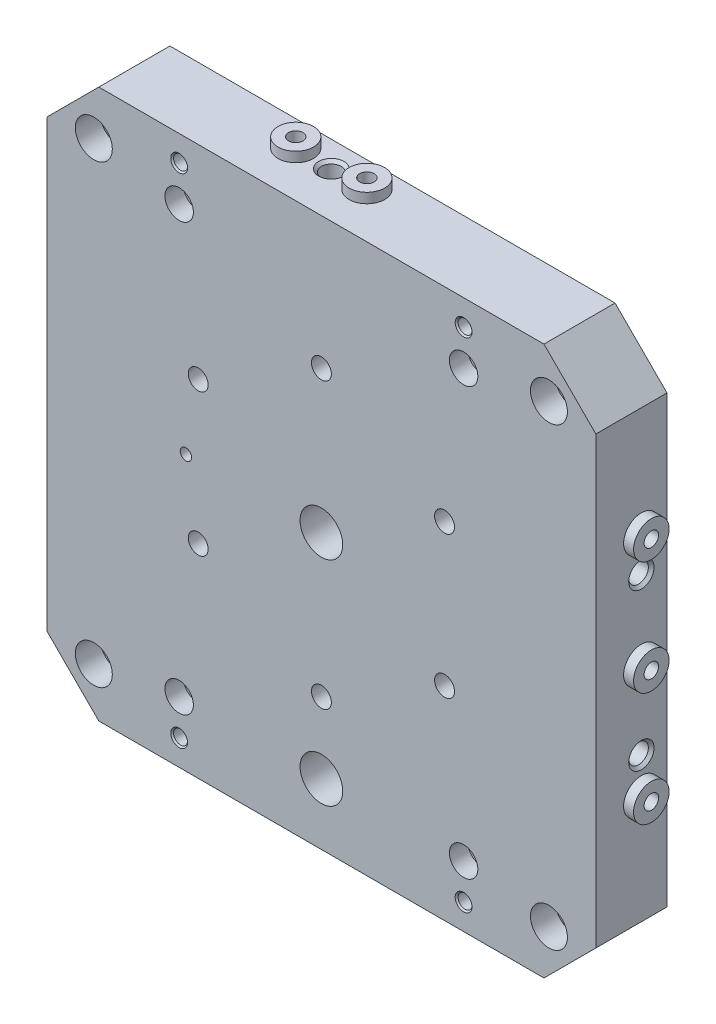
from build123d import *

# Parameters (mm, degrees)
BOSS_EXTRU_1_DEPTH            = 50
ESQUISSE2_R                   = 12.5
BOSS_EXTRU_2_DEPTH            = 7
ESQUISSE3_R                   = 12.5
BOSS_EXTRU_3_DEPTH            = 7
ESQUISSE8_W                   = 15
ESQUISSE8_H                   = 52
ESQUISSE9_W                   = 15
ESQUISSE9_H                   = 52
ESQUISSE21_R                  = 12.5
BOSS_EXTRU_4_DEPTH            = 7
ESQUISSE22_R                  = 12.5
BOSS_EXTRU_5_DEPTH            = 7
ESQUISSE23_R                  = 12.5
BOSS_EXTRU_6_DEPTH            = 7
ENL_V_MAT_EXTRU_1_DEPTH       = 25
ENL_V_MAT_EXTRU_1_DEPTH_BACK  = 25
ESQUISSE26_R                  = 5
ENL_V_MAT_EXTRU_2_DEPTH       = 25
ENL_V_MAT_EXTRU_2_DEPTH_BACK  = 25
ESQUISSE27_R                  = 5
ENL_V_MAT_EXTRU_3_DEPTH       = 25
ENL_V_MAT_EXTRU_3_DEPTH_BACK  = 25
ESQUISSE28_R                  = 5
ENL_V_MAT_EXTRU_4_DEPTH       = 25
ENL_V_MAT_EXTRU_4_DEPTH_BACK  = 25
ESQUISSE29_R                  = 5
ENL_V_MAT_EXTRU_5_DEPTH       = 25
ENL_V_MAT_EXTRU_5_DEPTH_BACK  = 25
ESQUISSE30_R                  = 5
TROU_TARAUD_M121_D            = 10.2
TROU_TARAUD_M121_DEPTH        = 32.75
TROU_TARAUD_M121_TIP          = 3.064389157
TROU_TARAUD_M122_D            = 10.2
TROU_TARAUD_M122_DEPTH        = 32.75
TROU_TARAUD_M122_TIP          = 3.064389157
TROU_TARAUD_M161_D            = 14
DIAM_TRE_DU_PER_AGE_8_0_8_1_D = 8


with BuildPart() as part:
    # Esquisse1 → Boss.-Extru.1 (new body)
    with BuildSketch(Plane.XY):
        Polygon((-193, -156.5), (-156.5, -193), (156.5, -193), (193, -156.5), (193, 156.5), (156.5, 193), (-156.5, 193), (-193, 156.5), align=None)
    extrude(amount=BOSS_EXTRU_1_DEPTH)

    # Esquisse2 → Boss.-Extru.2 (add)
    with BuildSketch(Plane(origin=(0, 193, 0), x_dir=(-1, 0, 0), z_dir=(0, 1, 0))):
        with Locations(Location((0, 18, 0), (0, 0, 270))):
            Circle(ESQUISSE2_R)
    extrude(amount=BOSS_EXTRU_2_DEPTH)

    # Esquisse3 → Boss.-Extru.3 (add)
    with BuildSketch(Plane(origin=(0, 193, 0), x_dir=(-1, 0, 0), z_dir=(0, 1, 0))):
        with Locations(Location((50, 18, 0), (0, 0, 270))):
            Circle(ESQUISSE3_R)
    extrude(amount=BOSS_EXTRU_3_DEPTH)

    # Esquisse4 → Enl_vement de mati_re-R_volution1 (revolve, cut)
    with BuildSketch(Plane(origin=(0, 160, 0), x_dir=(-1, 0, 0), z_dir=(0, 1, 0))):
        Polygon((160, -1), (151.25, -1), (151.25, 32.5), (147, 32.5), (147, 51), (160, 51), align=None)
    revolve(axis=Axis((-160, 160, 51), (0, 0, -1)), mode=Mode.SUBTRACT)

    # Esquisse5 → Enl_vement de mati_re-R_volution2 (revolve, cut)
    with BuildSketch(Plane(origin=(0, 160, 0), x_dir=(-1, 0, 0), z_dir=(0, 1, 0))):
        Polygon((-160, -1), (-168.75, -1), (-168.75, 32.5), (-173, 32.5), (-173, 51), (-160, 51), align=None)
    revolve(axis=Axis((160, 160, 51), (0, 0, -1)), mode=Mode.SUBTRACT)

    # Esquisse6 → Enl_vement de mati_re-R_volution3 (revolve, cut)
    with BuildSketch(Plane(origin=(0, -160, 0), x_dir=(-1, 0, 0), z_dir=(0, 1, 0))):
        Polygon((-160, -1), (-168.75, -1), (-168.75, 32.5), (-173, 32.5), (-173, 51), (-160, 51), align=None)
    revolve(axis=Axis((160, -160, 51), (0, 0, -1)), mode=Mode.SUBTRACT)

    # Esquisse7 → Enl_vement de mati_re-R_volution4 (revolve, cut)
    with BuildSketch(Plane(origin=(0, -160, 0), x_dir=(-1, 0, 0), z_dir=(0, 1, 0))):
        Polygon((160, -1), (151.25, -1), (151.25, 32.5), (147, 32.5), (147, 51), (160, 51), align=None)
    revolve(axis=Axis((-160, -160, 51), (0, 0, -1)), mode=Mode.SUBTRACT)

    # Esquisse8 → Enl_vement de mati_re-R_volution5 (revolve, cut)
    with BuildSketch(Plane(origin=(0, 0, 0), x_dir=(1, 0, 0), z_dir=(0, 1, 0))):
        with Locations((7.5, -25)):
            Rectangle(ESQUISSE8_W, ESQUISSE8_H)
    revolve(axis=Axis((0, 0, 51), (0, 0, -1)), mode=Mode.SUBTRACT)

    # Esquisse9 → Enl_vement de mati_re-R_volution6 (revolve, cut)
    with BuildSketch(Plane(origin=(0, -150, 0), x_dir=(-1, 0, 0), z_dir=(0, 1, 0))):
        with Locations((-7.5, 25)):
            Rectangle(ESQUISSE9_W, ESQUISSE9_H)
    revolve(axis=Axis((0, -150, 51), (0, 0, -1)), mode=Mode.SUBTRACT)

    # Esquisse10 → Enl_vement de mati_re-R_volution7 (revolve, cut)
    with BuildSketch(Plane(origin=(0, 150, 0), x_dir=(-1, 0, 0), z_dir=(0, 1, 0))):
        Polygon((-100, 51), (-90, 51), (-90, 37), (-93.25, 37), (-93.25, -1), (-100, -1), align=None)
    revolve(axis=Axis((100, 150, -1), (0, 0, 1)), mode=Mode.SUBTRACT)

    # Esquisse11 → Enl_vement de mati_re-R_volution8 (revolve, cut)
    with BuildSketch(Plane(origin=(0, 150, 0), x_dir=(-1, 0, 0), z_dir=(0, 1, 0))):
        Polygon((100, 51), (110, 51), (110, 37), (106.75, 37), (106.75, -1), (100, -1), align=None)
    revolve(axis=Axis((-100, 150, -1), (0, 0, 1)), mode=Mode.SUBTRACT)

    # Esquisse12 → Enl_vement de mati_re-R_volution9 (revolve, cut)
    with BuildSketch(Plane(origin=(0, -150, 0), x_dir=(-1, 0, 0), z_dir=(0, 1, 0))):
        Polygon((-100, 51), (-90, 51), (-90, 37), (-93.25, 37), (-93.25, -1), (-100, -1), align=None)
    revolve(axis=Axis((100, -150, -1), (0, 0, 1)), mode=Mode.SUBTRACT)

    # Esquisse13 → Enl_vement de mati_re-R_volution10 (revolve, cut)
    with BuildSketch(Plane(origin=(0, -150, 0), x_dir=(-1, 0, 0), z_dir=(0, 1, 0))):
        Polygon((100, 51), (110, 51), (110, 37), (106.75, 37), (106.75, -1), (100, -1), align=None)
    revolve(axis=Axis((-100, -150, -1), (0, 0, 1)), mode=Mode.SUBTRACT)

    # Esquisse14 → Enl_vement de mati_re-R_volution11 (revolve, cut)
    with BuildSketch(Plane(origin=(0, 175, 0), x_dir=(-1, 0, 0), z_dir=(0, 1, 0))):
        Polygon((100, -2), (92.083, -2), (95.083, 1), (95.083, 49), (92.083, 52), (100, 52), align=None)
    revolve(axis=Axis((-100, 175, 52), (0, 0, -1)), mode=Mode.SUBTRACT)

    # Esquisse15 → Enl_vement de mati_re-R_volution12 (revolve, cut)
    with BuildSketch(Plane(origin=(0, 175, 0), x_dir=(-1, 0, 0), z_dir=(0, 1, 0))):
        Polygon((-100, -2), (-107.917, -2), (-104.917, 1), (-104.917, 49), (-107.917, 52), (-100, 52), align=None)
    revolve(axis=Axis((100, 175, 52), (0, 0, -1)), mode=Mode.SUBTRACT)

    # Esquisse16 → Enl_vement de mati_re-R_volution13 (revolve, cut)
    with BuildSketch(Plane(origin=(0, -175, 0), x_dir=(-1, 0, 0), z_dir=(0, 1, 0))):
        Polygon((100, -2), (92.083, -2), (95.083, 1), (95.083, 49), (92.083, 52), (100, 52), align=None)
    revolve(axis=Axis((-100, -175, 52), (0, 0, -1)), mode=Mode.SUBTRACT)

    # Esquisse17 → Enl_vement de mati_re-R_volution14 (revolve, cut)
    with BuildSketch(Plane(origin=(0, -175, 0), x_dir=(-1, 0, 0), z_dir=(0, 1, 0))):
        Polygon((-100, -2), (-107.917, -2), (-104.917, 1), (-104.917, 49), (-107.917, 52), (-100, 52), align=None)
    revolve(axis=Axis((100, -175, 52), (0, 0, -1)), mode=Mode.SUBTRACT)

    # Esquisse20 → Enl_vement de mati_re-R_volution17 (revolve, cut)
    with BuildSketch(Plane(origin=(-25, 0, 0), x_dir=(0, 0, -1), z_dir=(1, 0, 0))):
        Polygon((-18, 194), (-8.0825, 194), (-11.0825, 191), (-11.0825, 127.993820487), (-18, 124), align=None)
    revolve(axis=Axis((-25, 124, 18), (0, 1, 0)), mode=Mode.SUBTRACT)

    # Esquisse21 → Boss.-Extru.4 (add)
    with BuildSketch(Plane(origin=(193, 0, 0), x_dir=(0, 0, -1), z_dir=(1, 0, 0))):
        with Locations(Location((-18, 0, 0), (0, 0, 180))):
            Circle(ESQUISSE21_R)
    extrude(amount=BOSS_EXTRU_4_DEPTH)

    # Esquisse22 → Boss.-Extru.5 (add)
    with BuildSketch(Plane(origin=(193, 0, 0), x_dir=(0, 0, -1), z_dir=(1, 0, 0))):
        with Locations(Location((-18, 80, 0), (0, 0, 180))):
            Circle(ESQUISSE22_R)
    extrude(amount=BOSS_EXTRU_5_DEPTH)

    # Esquisse23 → Boss.-Extru.6 (add)
    with BuildSketch(Plane(origin=(193, 0, 0), x_dir=(0, 0, -1), z_dir=(1, 0, 0))):
        with Locations(Location((-18, -80, 0), (0, 0, 180))):
            Circle(ESQUISSE23_R)
    extrude(amount=BOSS_EXTRU_6_DEPTH)

    # Esquisse24 → Enl_vement de mati_re-R_volution18 (revolve, cut)
    with BuildSketch(Plane(origin=(0, 55, 0), x_dir=(-1, 0, 0), z_dir=(0, 1, 0))):
        Polygon((-194, 18), (-194, 27.9175), (-191, 24.9175), (-127.993820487, 24.9175), (-124, 18), align=None)
    revolve(axis=Axis((124, 55, 18), (1, 0, 0)), mode=Mode.SUBTRACT)

    # Esquisse25 → Enl_vement de mati_re-R_volution19 (revolve, cut)
    with BuildSketch(Plane(origin=(0, -55, 0), x_dir=(-1, 0, 0), z_dir=(0, 1, 0))):
        Polygon((-194, 18), (-194, 27.9175), (-191, 24.9175), (-127.993820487, 24.9175), (-124, 18), align=None)
    revolve(axis=Axis((124, -55, 18), (1, 0, 0)), mode=Mode.SUBTRACT)

    # Esquisse26 → Enl_v. mat.-Extru.1 (cut, two sides: drawn at the far end of the back side and taken through both)
    with BuildSketch(Plane(origin=(0, 200, 0), x_dir=(-1, 0, 0), z_dir=(0, 1, 0)).offset(-ENL_V_MAT_EXTRU_1_DEPTH_BACK)):
        with Locations(Location((0, 18, 0), (0, 0, 90))):
            Circle(ESQUISSE26_R)
    extrude(amount=ENL_V_MAT_EXTRU_1_DEPTH + ENL_V_MAT_EXTRU_1_DEPTH_BACK, mode=Mode.SUBTRACT)

    # Esquisse27 → Enl_v. mat.-Extru.2 (cut, two sides: drawn at the far end of the back side and taken through both)
    with BuildSketch(Plane(origin=(0, 200, 0), x_dir=(-1, 0, 0), z_dir=(0, 1, 0)).offset(-ENL_V_MAT_EXTRU_2_DEPTH_BACK)):
        with Locations(Location((50, 18, 0), (0, 0, 90))):
            Circle(ESQUISSE27_R)
    extrude(amount=ENL_V_MAT_EXTRU_2_DEPTH + ENL_V_MAT_EXTRU_2_DEPTH_BACK, mode=Mode.SUBTRACT)

    # Esquisse28 → Enl_v. mat.-Extru.3 (cut, two sides: drawn at the far end of the back side and taken through both)
    with BuildSketch(Plane(origin=(200, 0, 0), x_dir=(0, 0, -1), z_dir=(1, 0, 0)).offset(-ENL_V_MAT_EXTRU_3_DEPTH_BACK)):
        with Locations((-18, 80)):
            Circle(ESQUISSE28_R)
    extrude(amount=ENL_V_MAT_EXTRU_3_DEPTH + ENL_V_MAT_EXTRU_3_DEPTH_BACK, mode=Mode.SUBTRACT)

    # Esquisse29 → Enl_v. mat.-Extru.4 (cut, two sides: drawn at the far end of the back side and taken through both)
    with BuildSketch(Plane(origin=(200, 0, 0), x_dir=(0, 0, -1), z_dir=(1, 0, 0)).offset(-ENL_V_MAT_EXTRU_4_DEPTH_BACK)):
        with Locations((-18, 0)):
            Circle(ESQUISSE29_R)
    extrude(amount=ENL_V_MAT_EXTRU_4_DEPTH + ENL_V_MAT_EXTRU_4_DEPTH_BACK, mode=Mode.SUBTRACT)

    # Esquisse30 → Enl_v. mat.-Extru.5 (cut, two sides: drawn at the far end of the back side and taken through both)
    with BuildSketch(Plane(origin=(200, 0, 0), x_dir=(0, 0, -1), z_dir=(1, 0, 0)).offset(-ENL_V_MAT_EXTRU_5_DEPTH_BACK)):
        with Locations((-18, -80)):
            Circle(ESQUISSE30_R)
    extrude(amount=ENL_V_MAT_EXTRU_5_DEPTH + ENL_V_MAT_EXTRU_5_DEPTH_BACK, mode=Mode.SUBTRACT)

    # Trou taraud_ M121
    with Locations(Plane(origin=(200, 0, 0), x_dir=(0, 0, -1), z_dir=(1, 0, 0))):
        with Locations((-18, 80), (-18, 0), (-18, -80)):
            Hole(TROU_TARAUD_M121_D / 2, depth=TROU_TARAUD_M121_DEPTH)
            with Locations((0, 0, -(TROU_TARAUD_M121_DEPTH + TROU_TARAUD_M121_TIP / 2))):  # 118° drill point
                Cone(0, TROU_TARAUD_M121_D / 2, TROU_TARAUD_M121_TIP, mode=Mode.SUBTRACT)

    # Trou taraud_ M122
    with Locations(Plane(origin=(0, 200, 0), x_dir=(-1, 0, 0), z_dir=(0, 1, 0))):
        with Locations((0, 18), (50, 18)):
            Hole(TROU_TARAUD_M122_D / 2, depth=TROU_TARAUD_M122_DEPTH)
            with Locations((0, 0, -(TROU_TARAUD_M122_DEPTH + TROU_TARAUD_M122_TIP / 2))):  # 118° drill point
                Cone(0, TROU_TARAUD_M122_D / 2, TROU_TARAUD_M122_TIP, mode=Mode.SUBTRACT)

    # Trou taraud_ M161 (through all)
    with Locations(Plane(origin=(0, 0, 50), x_dir=(0, -1, 0), z_dir=(0, 0, 1))):
        with Locations((-50, -86.602540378), (-50, 86.602540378), (50, 86.602540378), (50, -86.602540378), (100, 0), (-100, 0)):
            Hole(TROU_TARAUD_M161_D / 2)

    # Diam_tre du per_age _8.0 _8_1 (through all)
    with Locations(Plane.XY.offset(50)):
        with Locations((-95.25, 0)):
            Hole(DIAM_TRE_DU_PER_AGE_8_0_8_1_D / 2)


solid = part.part
